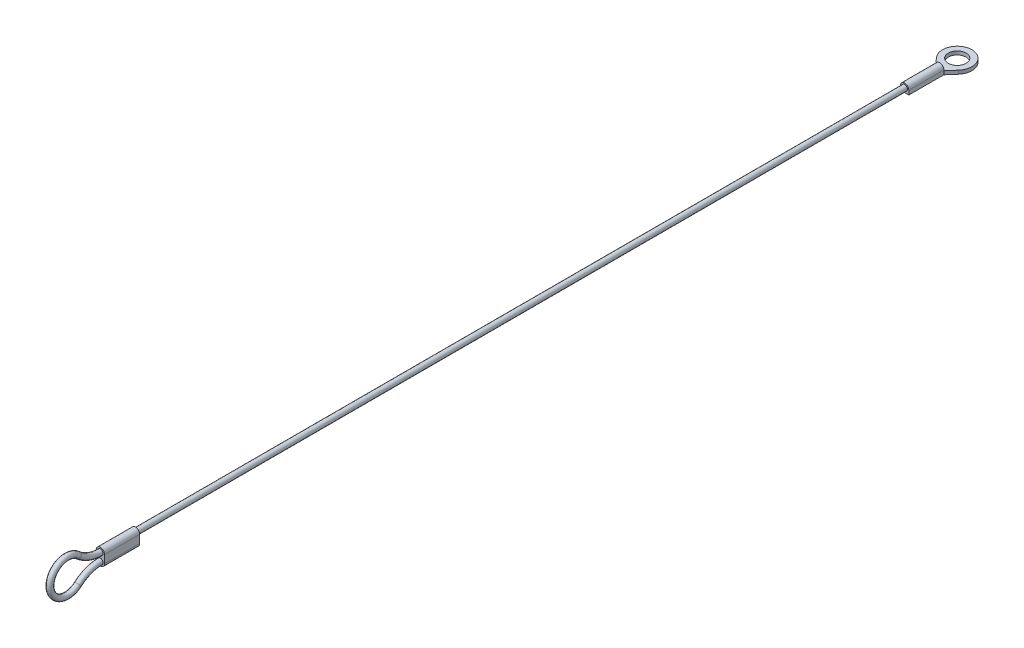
from build123d import *

# Parameters (mm, degrees)
SKETCH2_R           = 0.795
BOSS_EXTRUDE1_DEPTH = 10
BOSS_EXTRUDE2_DEPTH = 10
SKETCH5_R           = 2.54
BOSS_EXTRUDE3_DEPTH = 1.01


with BuildPart() as part:
    # Sweep1: sweep along a path in Sketch1
    with BuildLine(Plane(origin=(0, 0, 0), x_dir=(0, 0, -1), z_dir=(1, 0, 0))) as sweep1_path:
        Line((0, 0), (-229.4, 0))
        ThreePointArc((-229.4, 0), (-232.825492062, 0.631945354), (-235.8, 2.444582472))
        ThreePointArc((-235.8, 2.444582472), (-243.8, -1.133126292), (-235.8, -4.710835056))
        ThreePointArc((-235.8, -4.710835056), (-232.825492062, -2.898197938), (-229.4, -2.266252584))
    # Sketch2 → Sweep1 (sweep)
    with BuildSketch(Plane.XY):
        Circle(SKETCH2_R)
    sweep(path=sweep1_path.line)

    # Sketch3 → Boss-Extrude1 (add)
    with BuildSketch(Plane(origin=(0, 0, 229.4), x_dir=(-1, 0, 0), z_dir=(0, 0, -1))):
        with BuildLine():
            Line((1.195, 0), (1.195, -2.266252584))
            ThreePointArc((1.195, -2.266252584), (0, -3.461252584), (-1.195, -2.266252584))
            Line((-1.195, -2.266252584), (-1.195, 0))
            ThreePointArc((-1.195, 0), (0, 1.195), (1.195, 0))
        make_face()
    extrude(amount=BOSS_EXTRUDE1_DEPTH)

    # Sketch4 → Boss-Extrude2 (add)
    with BuildSketch(Plane(origin=(0, 0, 0), x_dir=(-1, 0, 0), z_dir=(0, 0, -1))):
        with BuildLine():
            Line((-1.195, 0), (-1.195, -1.195))
            Line((-1.195, -1.195), (0, -1.195))
            Line((0, -1.195), (1.195, -1.195))
            Line((1.195, -1.195), (1.195, 0))
            ThreePointArc((1.195, 0), (0, 1.195), (-1.195, 0))
        make_face()
    extrude(amount=BOSS_EXTRUDE2_DEPTH)

    # Sketch5 → Boss-Extrude3 (add)
    with BuildSketch(Plane.XZ.offset(1.195)):
        with BuildLine():
            Line((-1.195, -10), (1.195, -10))
            Line((1.195, -10), (3.155012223, -12.242827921))
            ThreePointArc((3.155012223, -12.242827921), (0, -19.19), (-3.155012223, -12.242827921))
            Line((-3.155012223, -12.242827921), (-1.195, -10))
        make_face()
        with Locations(Location((0, -15, 0), (0, 0, 270))):
            Circle(SKETCH5_R, mode=Mode.SUBTRACT)
    extrude(amount=-BOSS_EXTRUDE3_DEPTH)


solid = part.part
